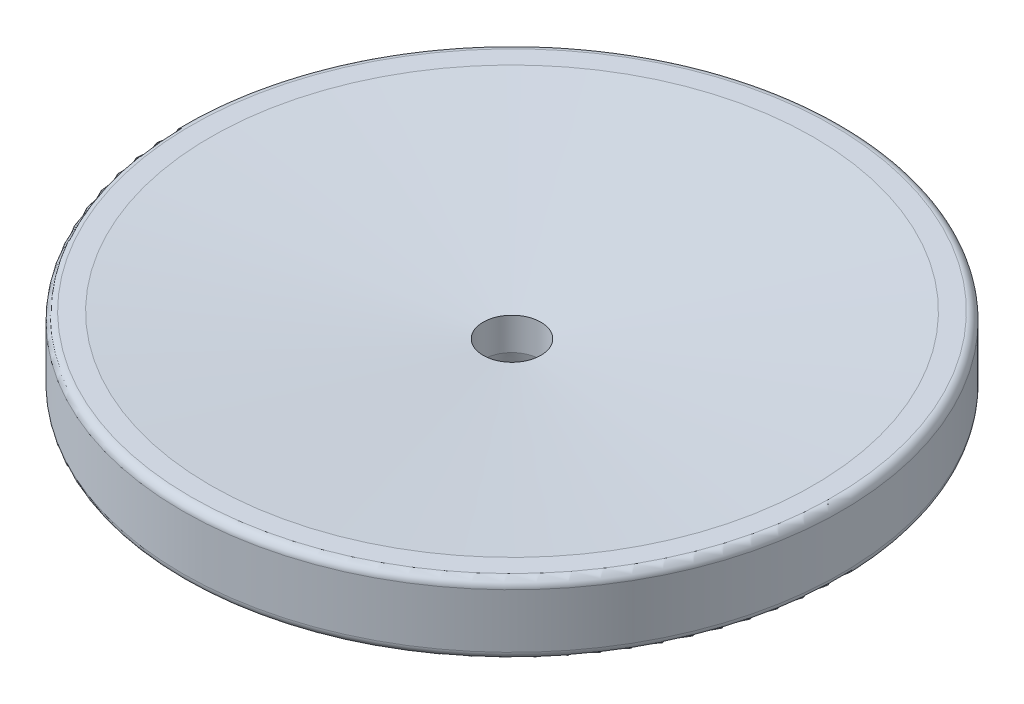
ISO-10303-21;
HEADER;
FILE_DESCRIPTION(('STEP AP214'),'2;1');
FILE_NAME('part.step','',(''),(''),'','','');
FILE_SCHEMA(('AUTOMOTIVE_DESIGN { 1 0 10303 214 1 1 1 1 }'));
ENDSEC;
DATA;
#1=APPLICATION_CONTEXT('core data for automotive mechanical design processes');
#2=APPLICATION_PROTOCOL_DEFINITION('international standard','automotive_design',2000,#1);
#3=PRODUCT_CONTEXT('',#1,'mechanical');
#4=PRODUCT('Part','Part','',(#3));
#5=PRODUCT_RELATED_PRODUCT_CATEGORY('part','',(#4));
#6=PRODUCT_DEFINITION_FORMATION('','',#4);
#7=PRODUCT_DEFINITION_CONTEXT('part definition',#1,'design');
#8=PRODUCT_DEFINITION('design','',#6,#7);
#9=PRODUCT_DEFINITION_SHAPE('','',#8);
#10=(LENGTH_UNIT() NAMED_UNIT(*) SI_UNIT(.MILLI.,.METRE.));
#11=(NAMED_UNIT(*) PLANE_ANGLE_UNIT() SI_UNIT($,.RADIAN.));
#12=(NAMED_UNIT(*) SI_UNIT($,.STERADIAN.) SOLID_ANGLE_UNIT());
#13=UNCERTAINTY_MEASURE_WITH_UNIT(LENGTH_MEASURE(1.E-05),#10,'distance_accuracy_value','');
#14=(GEOMETRIC_REPRESENTATION_CONTEXT(3) GLOBAL_UNCERTAINTY_ASSIGNED_CONTEXT((#13)) GLOBAL_UNIT_ASSIGNED_CONTEXT((#10,
#11,#12)) REPRESENTATION_CONTEXT('',''));
#15=CARTESIAN_POINT('',(0.,0.,0.));
#16=DIRECTION('',(0.,0.,1.));
#17=DIRECTION('',(1.,0.,0.));
#18=AXIS2_PLACEMENT_3D('',#15,#16,#17);
#19=CARTESIAN_POINT('',(0.,0.,0.));
#20=DIRECTION('',(0.,1.,0.));
#21=DIRECTION('',(0.,0.,1.));
#22=AXIS2_PLACEMENT_3D('',#19,#20,#21);
#23=PLANE('',#22);
#24=CARTESIAN_POINT('',(0.,0.,0.));
#25=DIRECTION('',(0.,-1.,0.));
#26=DIRECTION('',(0.,0.,-1.));
#27=AXIS2_PLACEMENT_3D('',#24,#25,#26);
#28=CIRCLE('',#27,41.275);
#29=CARTESIAN_POINT('',(0.,0.,-41.275));
#30=VERTEX_POINT('',#29);
#31=EDGE_CURVE('E64',#30,#30,#28,.T.);
#32=ORIENTED_EDGE('',*,*,#31,.F.);
#33=EDGE_LOOP('',(#32));
#34=FACE_BOUND('',#33,.T.);
#35=CARTESIAN_POINT('',(-41.3984391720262,0.,23.9014000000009));
#36=DIRECTION('',(0.,-1.,0.));
#37=DIRECTION('',(0.,0.,-1.));
#38=AXIS2_PLACEMENT_3D('',#35,#36,#37);
#39=CIRCLE('',#38,1.72719999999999);
#40=CARTESIAN_POINT('',(-41.3984391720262,0.,22.1742000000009));
#41=VERTEX_POINT('',#40);
#42=EDGE_CURVE('E102',#41,#41,#39,.T.);
#43=ORIENTED_EDGE('',*,*,#42,.F.);
#44=EDGE_LOOP('',(#43));
#45=FACE_BOUND('',#44,.T.);
#46=CARTESIAN_POINT('',(-47.8028,0.,1.00267016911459E-12));
#47=DIRECTION('',(0.,-1.,0.));
#48=DIRECTION('',(0.,0.,-1.));
#49=AXIS2_PLACEMENT_3D('',#46,#47,#48);
#50=CIRCLE('',#49,1.72719999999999);
#51=CARTESIAN_POINT('',(-47.8028,0.,-1.72719999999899));
#52=VERTEX_POINT('',#51);
#53=EDGE_CURVE('E108',#52,#52,#50,.T.);
#54=ORIENTED_EDGE('',*,*,#53,.F.);
#55=EDGE_LOOP('',(#54));
#56=FACE_BOUND('',#55,.T.);
#57=CARTESIAN_POINT('',(-41.3984391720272,0.,-23.9013999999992));
#58=DIRECTION('',(0.,-1.,0.));
#59=DIRECTION('',(0.,0.,-1.));
#60=AXIS2_PLACEMENT_3D('',#57,#58,#59);
#61=CIRCLE('',#60,1.72719999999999);
#62=CARTESIAN_POINT('',(-41.3984391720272,0.,-25.6285999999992));
#63=VERTEX_POINT('',#62);
#64=EDGE_CURVE('E116',#63,#63,#61,.T.);
#65=ORIENTED_EDGE('',*,*,#64,.F.);
#66=EDGE_LOOP('',(#65));
#67=FACE_BOUND('',#66,.T.);
#68=CARTESIAN_POINT('',(-23.9014000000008,0.,-41.3984391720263));
#69=DIRECTION('',(0.,-1.,0.));
#70=DIRECTION('',(0.,0.,-1.));
#71=AXIS2_PLACEMENT_3D('',#68,#69,#70);
#72=CIRCLE('',#71,1.72719999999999);
#73=CARTESIAN_POINT('',(-23.9014000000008,0.,-43.1256391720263));
#74=VERTEX_POINT('',#73);
#75=EDGE_CURVE('E123',#74,#74,#72,.T.);
#76=ORIENTED_EDGE('',*,*,#75,.F.);
#77=EDGE_LOOP('',(#76));
#78=FACE_BOUND('',#77,.T.);
#79=CARTESIAN_POINT('',(23.9013999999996,0.,-41.398439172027));
#80=DIRECTION('',(0.,-1.,0.));
#81=DIRECTION('',(0.,0.,-1.));
#82=AXIS2_PLACEMENT_3D('',#79,#80,#81);
#83=CIRCLE('',#82,1.72719999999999);
#84=CARTESIAN_POINT('',(23.9013999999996,0.,-43.125639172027));
#85=VERTEX_POINT('',#84);
#86=EDGE_CURVE('E135',#85,#85,#83,.T.);
#87=ORIENTED_EDGE('',*,*,#86,.F.);
#88=EDGE_LOOP('',(#87));
#89=FACE_BOUND('',#88,.T.);
#90=CARTESIAN_POINT('',(41.3984391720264,0.,-23.9014000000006));
#91=DIRECTION('',(0.,-1.,0.));
#92=DIRECTION('',(0.,0.,-1.));
#93=AXIS2_PLACEMENT_3D('',#90,#91,#92);
#94=CIRCLE('',#93,1.72719999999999);
#95=CARTESIAN_POINT('',(41.3984391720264,0.,-25.6286000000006));
#96=VERTEX_POINT('',#95);
#97=EDGE_CURVE('E141',#96,#96,#94,.T.);
#98=ORIENTED_EDGE('',*,*,#97,.F.);
#99=EDGE_LOOP('',(#98));
#100=FACE_BOUND('',#99,.T.);
#101=CARTESIAN_POINT('',(47.8028,0.,-6.66133814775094E-13));
#102=DIRECTION('',(0.,-1.,0.));
#103=DIRECTION('',(0.,0.,-1.));
#104=AXIS2_PLACEMENT_3D('',#101,#102,#103);
#105=CIRCLE('',#104,1.72719999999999);
#106=CARTESIAN_POINT('',(47.8028,0.,-1.72720000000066));
#107=VERTEX_POINT('',#106);
#108=EDGE_CURVE('E147',#107,#107,#105,.T.);
#109=ORIENTED_EDGE('',*,*,#108,.F.);
#110=EDGE_LOOP('',(#109));
#111=FACE_BOUND('',#110,.T.);
#112=CARTESIAN_POINT('',(41.3984391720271,0.,23.9013999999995));
#113=DIRECTION('',(0.,-1.,0.));
#114=DIRECTION('',(0.,0.,-1.));
#115=AXIS2_PLACEMENT_3D('',#112,#113,#114);
#116=CIRCLE('',#115,1.72719999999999);
#117=CARTESIAN_POINT('',(41.3984391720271,0.,22.1741999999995));
#118=VERTEX_POINT('',#117);
#119=EDGE_CURVE('E153',#118,#118,#116,.T.);
#120=ORIENTED_EDGE('',*,*,#119,.F.);
#121=EDGE_LOOP('',(#120));
#122=FACE_BOUND('',#121,.T.);
#123=CARTESIAN_POINT('',(23.9014000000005,0.,41.3984391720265));
#124=DIRECTION('',(0.,-1.,0.));
#125=DIRECTION('',(0.,0.,-1.));
#126=AXIS2_PLACEMENT_3D('',#123,#124,#125);
#127=CIRCLE('',#126,1.72719999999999);
#128=CARTESIAN_POINT('',(23.9014000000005,0.,39.6712391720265));
#129=VERTEX_POINT('',#128);
#130=EDGE_CURVE('E159',#129,#129,#127,.T.);
#131=ORIENTED_EDGE('',*,*,#130,.F.);
#132=EDGE_LOOP('',(#131));
#133=FACE_BOUND('',#132,.T.);
#134=CARTESIAN_POINT('',(4.9960036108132E-13,0.,47.8028));
#135=DIRECTION('',(0.,-1.,0.));
#136=DIRECTION('',(0.,0.,-1.));
#137=AXIS2_PLACEMENT_3D('',#134,#135,#136);
#138=CIRCLE('',#137,1.72719999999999);
#139=CARTESIAN_POINT('',(4.9960036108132E-13,0.,46.0756));
#140=VERTEX_POINT('',#139);
#141=EDGE_CURVE('E165',#140,#140,#138,.T.);
#142=ORIENTED_EDGE('',*,*,#141,.F.);
#143=EDGE_LOOP('',(#142));
#144=FACE_BOUND('',#143,.T.);
#145=CARTESIAN_POINT('',(-23.9013999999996,0.,41.398439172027));
#146=DIRECTION('',(0.,-1.,0.));
#147=DIRECTION('',(0.,0.,-1.));
#148=AXIS2_PLACEMENT_3D('',#145,#146,#147);
#149=CIRCLE('',#148,1.72719999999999);
#150=CARTESIAN_POINT('',(-23.9013999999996,0.,39.671239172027));
#151=VERTEX_POINT('',#150);
#152=EDGE_CURVE('E171',#151,#151,#149,.T.);
#153=ORIENTED_EDGE('',*,*,#152,.F.);
#154=EDGE_LOOP('',(#153));
#155=FACE_BOUND('',#154,.T.);
#156=CARTESIAN_POINT('',(0.,0.,0.));
#157=DIRECTION('',(0.,1.,0.));
#158=DIRECTION('',(0.,0.,1.));
#159=AXIS2_PLACEMENT_3D('',#156,#157,#158);
#160=CIRCLE('',#159,52.5526);
#161=CARTESIAN_POINT('',(0.,0.,52.5526));
#162=VERTEX_POINT('',#161);
#163=EDGE_CURVE('E201',#162,#162,#160,.T.);
#164=ORIENTED_EDGE('',*,*,#163,.F.);
#165=EDGE_LOOP('',(#164));
#166=FACE_BOUND('',#165,.T.);
#167=CARTESIAN_POINT('',(-8.36136715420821E-13,0.,-47.8028));
#168=DIRECTION('',(0.,-1.,0.));
#169=DIRECTION('',(0.,0.,-1.));
#170=AXIS2_PLACEMENT_3D('',#167,#168,#169);
#171=CIRCLE('',#170,1.72719999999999);
#172=CARTESIAN_POINT('',(-8.36136715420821E-13,0.,-49.53));
#173=VERTEX_POINT('',#172);
#174=EDGE_CURVE('E129',#173,#173,#171,.T.);
#175=ORIENTED_EDGE('',*,*,#174,.F.);
#176=EDGE_LOOP('',(#175));
#177=FACE_BOUND('',#176,.T.);
#178=ADVANCED_FACE('F41',(#34,#45,#56,#67,#78,#89,#100,#111,#122,#133,#144,#155,#166,#177),#23,.F.);
#179=CARTESIAN_POINT('',(0.,13.6144,0.));
#180=DIRECTION('',(0.,-1.,0.));
#181=DIRECTION('',(0.,0.,-1.));
#182=AXIS2_PLACEMENT_3D('',#179,#180,#181);
#183=CYLINDRICAL_SURFACE('',#182,63.5);
#184=CARTESIAN_POINT('',(0.,12.0269,0.));
#185=DIRECTION('',(0.,1.,0.));
#186=DIRECTION('',(0.,0.,1.));
#187=AXIS2_PLACEMENT_3D('',#184,#185,#186);
#188=CIRCLE('',#187,63.5);
#189=CARTESIAN_POINT('',(0.,12.0269,63.5));
#190=VERTEX_POINT('',#189);
#191=EDGE_CURVE('E50',#190,#190,#188,.F.);
#192=ORIENTED_EDGE('',*,*,#191,.T.);
#193=EDGE_LOOP('',(#192));
#194=FACE_BOUND('',#193,.T.);
#195=CARTESIAN_POINT('',(0.,1.5875,0.));
#196=DIRECTION('',(0.,1.,0.));
#197=DIRECTION('',(0.,0.,1.));
#198=AXIS2_PLACEMENT_3D('',#195,#196,#197);
#199=CIRCLE('',#198,63.5);
#200=CARTESIAN_POINT('',(0.,1.5875,63.5));
#201=VERTEX_POINT('',#200);
#202=EDGE_CURVE('E58',#201,#201,#199,.T.);
#203=ORIENTED_EDGE('',*,*,#202,.T.);
#204=EDGE_LOOP('',(#203));
#205=FACE_BOUND('',#204,.T.);
#206=ADVANCED_FACE('F214',(#194,#205),#183,.T.);
#207=CARTESIAN_POINT('',(0.,13.6144,0.));
#208=DIRECTION('',(0.,1.,0.));
#209=DIRECTION('',(0.,0.,1.));
#210=AXIS2_PLACEMENT_3D('',#207,#208,#209);
#211=PLANE('',#210);
#212=CARTESIAN_POINT('',(0.,13.6144,0.));
#213=DIRECTION('',(0.,-1.,0.));
#214=DIRECTION('',(0.,0.,-1.));
#215=AXIS2_PLACEMENT_3D('',#212,#213,#214);
#216=CIRCLE('',#215,58.1025);
#217=CARTESIAN_POINT('',(0.,13.6144,58.1025));
#218=VERTEX_POINT('',#217);
#219=EDGE_CURVE('E84',#218,#218,#216,.T.);
#220=ORIENTED_EDGE('',*,*,#219,.T.);
#221=EDGE_LOOP('',(#220));
#222=FACE_BOUND('',#221,.T.);
#223=CARTESIAN_POINT('',(0.,13.6144,0.));
#224=DIRECTION('',(0.,1.,0.));
#225=DIRECTION('',(0.,0.,1.));
#226=AXIS2_PLACEMENT_3D('',#223,#224,#225);
#227=CIRCLE('',#226,61.9125);
#228=CARTESIAN_POINT('',(0.,13.6144,61.9125));
#229=VERTEX_POINT('',#228);
#230=EDGE_CURVE('E208',#229,#229,#227,.T.);
#231=ORIENTED_EDGE('',*,*,#230,.T.);
#232=EDGE_LOOP('',(#231));
#233=FACE_BOUND('',#232,.T.);
#234=ADVANCED_FACE('F236',(#222,#233),#211,.T.);
#235=CARTESIAN_POINT('',(0.,0.,0.));
#236=DIRECTION('',(0.,1.,0.));
#237=DIRECTION('',(0.,0.,1.));
#238=AXIS2_PLACEMENT_3D('',#235,#236,#237);
#239=CIRCLE('',#238,61.9125);
#240=CARTESIAN_POINT('',(0.,0.,61.9125));
#241=VERTEX_POINT('',#240);
#242=EDGE_CURVE('E10',#241,#241,#239,.F.);
#243=ORIENTED_EDGE('',*,*,#242,.T.);
#244=EDGE_LOOP('',(#243));
#245=FACE_BOUND('',#244,.T.);
#246=CARTESIAN_POINT('',(0.,0.,0.));
#247=DIRECTION('',(0.,1.,0.));
#248=DIRECTION('',(0.,0.,1.));
#249=AXIS2_PLACEMENT_3D('',#246,#247,#248);
#250=CIRCLE('',#249,57.4294);
#251=CARTESIAN_POINT('',(0.,0.,57.4294));
#252=VERTEX_POINT('',#251);
#253=EDGE_CURVE('E205',#252,#252,#250,.T.);
#254=ORIENTED_EDGE('',*,*,#253,.T.);
#255=EDGE_LOOP('',(#254));
#256=FACE_BOUND('',#255,.T.);
#257=ADVANCED_FACE('F232',(#245,#256),#23,.F.);
#258=CARTESIAN_POINT('',(0.,0.126999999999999,0.));
#259=DIRECTION('',(0.,1.,0.));
#260=DIRECTION('',(0.,0.,1.));
#261=AXIS2_PLACEMENT_3D('',#258,#259,#260);
#262=TOROIDAL_SURFACE('',#261,57.4294,0.127000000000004);
#263=ORIENTED_EDGE('',*,*,#253,.F.);
#264=EDGE_LOOP('',(#263));
#265=FACE_BOUND('',#264,.T.);
#266=CARTESIAN_POINT('',(0.,0.126999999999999,0.));
#267=DIRECTION('',(0.,1.,0.));
#268=DIRECTION('',(0.,0.,1.));
#269=AXIS2_PLACEMENT_3D('',#266,#267,#268);
#270=CIRCLE('',#269,57.3024);
#271=CARTESIAN_POINT('',(0.,0.126999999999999,57.3024));
#272=VERTEX_POINT('',#271);
#273=EDGE_CURVE('E177',#272,#272,#270,.T.);
#274=ORIENTED_EDGE('',*,*,#273,.T.);
#275=EDGE_LOOP('',(#274));
#276=FACE_BOUND('',#275,.T.);
#277=ADVANCED_FACE('F242',(#265,#276),#262,.T.);
#278=CARTESIAN_POINT('',(0.,0.127,0.));
#279=DIRECTION('',(0.,1.,0.));
#280=DIRECTION('',(0.,0.,1.));
#281=AXIS2_PLACEMENT_3D('',#278,#279,#280);
#282=TOROIDAL_SURFACE('',#281,52.5526,0.127000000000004);
#283=CARTESIAN_POINT('',(0.,0.127,0.));
#284=DIRECTION('',(0.,1.,0.));
#285=DIRECTION('',(0.,0.,1.));
#286=AXIS2_PLACEMENT_3D('',#283,#284,#285);
#287=CIRCLE('',#286,52.6796);
#288=CARTESIAN_POINT('',(0.,0.127,52.6796));
#289=VERTEX_POINT('',#288);
#290=EDGE_CURVE('E197',#289,#289,#287,.T.);
#291=ORIENTED_EDGE('',*,*,#290,.F.);
#292=EDGE_LOOP('',(#291));
#293=FACE_BOUND('',#292,.T.);
#294=ORIENTED_EDGE('',*,*,#163,.T.);
#295=EDGE_LOOP('',(#294));
#296=FACE_BOUND('',#295,.T.);
#297=ADVANCED_FACE('F247',(#293,#296),#282,.T.);
#298=CARTESIAN_POINT('',(0.,0.,0.));
#299=DIRECTION('',(0.,1.,0.));
#300=DIRECTION('',(0.,0.,1.));
#301=AXIS2_PLACEMENT_3D('',#298,#299,#300);
#302=CYLINDRICAL_SURFACE('',#301,52.6796);
#303=CARTESIAN_POINT('',(0.,2.1971,0.));
#304=DIRECTION('',(0.,1.,0.));
#305=DIRECTION('',(0.,0.,1.));
#306=AXIS2_PLACEMENT_3D('',#303,#304,#305);
#307=CIRCLE('',#306,52.6796);
#308=CARTESIAN_POINT('',(0.,2.1971,52.6796));
#309=VERTEX_POINT('',#308);
#310=EDGE_CURVE('E193',#309,#309,#307,.T.);
#311=ORIENTED_EDGE('',*,*,#310,.F.);
#312=EDGE_LOOP('',(#311));
#313=FACE_BOUND('',#312,.T.);
#314=ORIENTED_EDGE('',*,*,#290,.T.);
#315=EDGE_LOOP('',(#314));
#316=FACE_BOUND('',#315,.T.);
#317=ADVANCED_FACE('F278',(#313,#316),#302,.T.);
#318=CARTESIAN_POINT('',(0.,2.1971,0.));
#319=DIRECTION('',(0.,1.,0.));
#320=DIRECTION('',(0.,0.,1.));
#321=AXIS2_PLACEMENT_3D('',#318,#319,#320);
#322=TOROIDAL_SURFACE('',#321,53.1241,0.4445);
#323=CARTESIAN_POINT('',(0.,2.6416,0.));
#324=DIRECTION('',(0.,1.,0.));
#325=DIRECTION('',(0.,0.,1.));
#326=AXIS2_PLACEMENT_3D('',#323,#324,#325);
#327=CIRCLE('',#326,53.1241);
#328=CARTESIAN_POINT('',(0.,2.6416,53.1241));
#329=VERTEX_POINT('',#328);
#330=EDGE_CURVE('E189',#329,#329,#327,.T.);
#331=ORIENTED_EDGE('',*,*,#330,.F.);
#332=EDGE_LOOP('',(#331));
#333=FACE_BOUND('',#332,.T.);
#334=ORIENTED_EDGE('',*,*,#310,.T.);
#335=EDGE_LOOP('',(#334));
#336=FACE_BOUND('',#335,.T.);
#337=ADVANCED_FACE('F272',(#333,#336),#322,.F.);
#338=CARTESIAN_POINT('',(-56.8579,2.6416,0.));
#339=DIRECTION('',(0.,1.,0.));
#340=DIRECTION('',(0.,0.,1.));
#341=AXIS2_PLACEMENT_3D('',#338,#339,#340);
#342=PLANE('',#341);
#343=CARTESIAN_POINT('',(0.,2.6416,0.));
#344=DIRECTION('',(0.,1.,0.));
#345=DIRECTION('',(0.,0.,1.));
#346=AXIS2_PLACEMENT_3D('',#343,#344,#345);
#347=CIRCLE('',#346,56.8579);
#348=CARTESIAN_POINT('',(0.,2.6416,56.8579));
#349=VERTEX_POINT('',#348);
#350=EDGE_CURVE('E185',#349,#349,#347,.T.);
#351=ORIENTED_EDGE('',*,*,#350,.F.);
#352=EDGE_LOOP('',(#351));
#353=FACE_BOUND('',#352,.T.);
#354=ORIENTED_EDGE('',*,*,#330,.T.);
#355=EDGE_LOOP('',(#354));
#356=FACE_BOUND('',#355,.T.);
#357=ADVANCED_FACE('F266',(#353,#356),#342,.F.);
#358=CARTESIAN_POINT('',(0.,2.1971,0.));
#359=DIRECTION('',(0.,1.,0.));
#360=DIRECTION('',(0.,0.,1.));
#361=AXIS2_PLACEMENT_3D('',#358,#359,#360);
#362=TOROIDAL_SURFACE('',#361,56.8579,0.4445);
#363=CARTESIAN_POINT('',(0.,2.1971,0.));
#364=DIRECTION('',(0.,1.,0.));
#365=DIRECTION('',(0.,0.,1.));
#366=AXIS2_PLACEMENT_3D('',#363,#364,#365);
#367=CIRCLE('',#366,57.3024);
#368=CARTESIAN_POINT('',(0.,2.1971,57.3024));
#369=VERTEX_POINT('',#368);
#370=EDGE_CURVE('E181',#369,#369,#367,.T.);
#371=ORIENTED_EDGE('',*,*,#370,.F.);
#372=EDGE_LOOP('',(#371));
#373=FACE_BOUND('',#372,.T.);
#374=ORIENTED_EDGE('',*,*,#350,.T.);
#375=EDGE_LOOP('',(#374));
#376=FACE_BOUND('',#375,.T.);
#377=ADVANCED_FACE('F260',(#373,#376),#362,.F.);
#378=CARTESIAN_POINT('',(0.,0.,0.));
#379=DIRECTION('',(0.,1.,0.));
#380=DIRECTION('',(0.,0.,1.));
#381=AXIS2_PLACEMENT_3D('',#378,#379,#380);
#382=CYLINDRICAL_SURFACE('',#381,57.3024);
#383=ORIENTED_EDGE('',*,*,#273,.F.);
#384=EDGE_LOOP('',(#383));
#385=FACE_BOUND('',#384,.T.);
#386=ORIENTED_EDGE('',*,*,#370,.T.);
#387=EDGE_LOOP('',(#386));
#388=FACE_BOUND('',#387,.T.);
#389=ADVANCED_FACE('F256',(#385,#388),#382,.F.);
#390=CARTESIAN_POINT('',(-23.9013999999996,8.89,41.398439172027));
#391=DIRECTION('',(0.,1.,0.));
#392=DIRECTION('',(0.,0.,1.));
#393=AXIS2_PLACEMENT_3D('',#390,#391,#392);
#394=PLANE('',#393);
#395=CARTESIAN_POINT('',(-23.9013999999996,8.89,41.398439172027));
#396=DIRECTION('',(0.,-1.,0.));
#397=DIRECTION('',(0.,0.,-1.));
#398=AXIS2_PLACEMENT_3D('',#395,#396,#397);
#399=CIRCLE('',#398,1.7272);
#400=CARTESIAN_POINT('',(-23.9013999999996,8.89,39.671239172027));
#401=VERTEX_POINT('',#400);
#402=EDGE_CURVE('E174',#401,#401,#399,.T.);
#403=ORIENTED_EDGE('',*,*,#402,.T.);
#404=EDGE_LOOP('',(#403));
#405=FACE_BOUND('',#404,.T.);
#406=ADVANCED_FACE('F259',(#405),#394,.F.);
#407=CARTESIAN_POINT('',(-23.9013999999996,0.,41.398439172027));
#408=DIRECTION('',(0.,-1.,0.));
#409=DIRECTION('',(0.,0.,-1.));
#410=AXIS2_PLACEMENT_3D('',#407,#408,#409);
#411=CYLINDRICAL_SURFACE('',#410,1.72719999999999);
#412=ORIENTED_EDGE('',*,*,#402,.F.);
#413=EDGE_LOOP('',(#412));
#414=FACE_BOUND('',#413,.T.);
#415=ORIENTED_EDGE('',*,*,#152,.T.);
#416=EDGE_LOOP('',(#415));
#417=FACE_BOUND('',#416,.T.);
#418=ADVANCED_FACE('F360',(#414,#417),#411,.F.);
#419=CARTESIAN_POINT('',(4.97422939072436E-13,8.89,47.8028));
#420=DIRECTION('',(0.,1.,0.));
#421=DIRECTION('',(0.,0.,1.));
#422=AXIS2_PLACEMENT_3D('',#419,#420,#421);
#423=PLANE('',#422);
#424=CARTESIAN_POINT('',(4.9960036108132E-13,8.89,47.8028));
#425=DIRECTION('',(0.,-1.,0.));
#426=DIRECTION('',(0.,0.,-1.));
#427=AXIS2_PLACEMENT_3D('',#424,#425,#426);
#428=CIRCLE('',#427,1.7272);
#429=CARTESIAN_POINT('',(4.9960036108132E-13,8.89,46.0756));
#430=VERTEX_POINT('',#429);
#431=EDGE_CURVE('E168',#430,#430,#428,.T.);
#432=ORIENTED_EDGE('',*,*,#431,.T.);
#433=EDGE_LOOP('',(#432));
#434=FACE_BOUND('',#433,.T.);
#435=ADVANCED_FACE('F356',(#434),#423,.F.);
#436=CARTESIAN_POINT('',(4.9960036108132E-13,0.,47.8028));
#437=DIRECTION('',(0.,-1.,0.));
#438=DIRECTION('',(0.,0.,-1.));
#439=AXIS2_PLACEMENT_3D('',#436,#437,#438);
#440=CYLINDRICAL_SURFACE('',#439,1.72719999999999);
#441=ORIENTED_EDGE('',*,*,#431,.F.);
#442=EDGE_LOOP('',(#441));
#443=FACE_BOUND('',#442,.T.);
#444=ORIENTED_EDGE('',*,*,#141,.T.);
#445=EDGE_LOOP('',(#444));
#446=FACE_BOUND('',#445,.T.);
#447=ADVANCED_FACE('F352',(#443,#446),#440,.F.);
#448=CARTESIAN_POINT('',(23.9014000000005,8.89,41.3984391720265));
#449=DIRECTION('',(0.,1.,0.));
#450=DIRECTION('',(0.,0.,1.));
#451=AXIS2_PLACEMENT_3D('',#448,#449,#450);
#452=PLANE('',#451);
#453=CARTESIAN_POINT('',(23.9014000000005,8.89,41.3984391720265));
#454=DIRECTION('',(0.,-1.,0.));
#455=DIRECTION('',(0.,0.,-1.));
#456=AXIS2_PLACEMENT_3D('',#453,#454,#455);
#457=CIRCLE('',#456,1.7272);
#458=CARTESIAN_POINT('',(23.9014000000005,8.89,39.6712391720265));
#459=VERTEX_POINT('',#458);
#460=EDGE_CURVE('E162',#459,#459,#457,.T.);
#461=ORIENTED_EDGE('',*,*,#460,.T.);
#462=EDGE_LOOP('',(#461));
#463=FACE_BOUND('',#462,.T.);
#464=ADVANCED_FACE('F348',(#463),#452,.F.);
#465=CARTESIAN_POINT('',(23.9014000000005,0.,41.3984391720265));
#466=DIRECTION('',(0.,-1.,0.));
#467=DIRECTION('',(0.,0.,-1.));
#468=AXIS2_PLACEMENT_3D('',#465,#466,#467);
#469=CYLINDRICAL_SURFACE('',#468,1.72719999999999);
#470=ORIENTED_EDGE('',*,*,#460,.F.);
#471=EDGE_LOOP('',(#470));
#472=FACE_BOUND('',#471,.T.);
#473=ORIENTED_EDGE('',*,*,#130,.T.);
#474=EDGE_LOOP('',(#473));
#475=FACE_BOUND('',#474,.T.);
#476=ADVANCED_FACE('F344',(#472,#475),#469,.F.);
#477=CARTESIAN_POINT('',(41.3984391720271,8.89,23.9013999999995));
#478=DIRECTION('',(0.,1.,0.));
#479=DIRECTION('',(0.,0.,1.));
#480=AXIS2_PLACEMENT_3D('',#477,#478,#479);
#481=PLANE('',#480);
#482=CARTESIAN_POINT('',(41.3984391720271,8.89,23.9013999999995));
#483=DIRECTION('',(0.,-1.,0.));
#484=DIRECTION('',(0.,0.,-1.));
#485=AXIS2_PLACEMENT_3D('',#482,#483,#484);
#486=CIRCLE('',#485,1.7272);
#487=CARTESIAN_POINT('',(41.3984391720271,8.89,22.1741999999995));
#488=VERTEX_POINT('',#487);
#489=EDGE_CURVE('E156',#488,#488,#486,.T.);
#490=ORIENTED_EDGE('',*,*,#489,.T.);
#491=EDGE_LOOP('',(#490));
#492=FACE_BOUND('',#491,.T.);
#493=ADVANCED_FACE('F340',(#492),#481,.F.);
#494=CARTESIAN_POINT('',(41.3984391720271,0.,23.9013999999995));
#495=DIRECTION('',(0.,-1.,0.));
#496=DIRECTION('',(0.,0.,-1.));
#497=AXIS2_PLACEMENT_3D('',#494,#495,#496);
#498=CYLINDRICAL_SURFACE('',#497,1.72719999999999);
#499=ORIENTED_EDGE('',*,*,#489,.F.);
#500=EDGE_LOOP('',(#499));
#501=FACE_BOUND('',#500,.T.);
#502=ORIENTED_EDGE('',*,*,#119,.T.);
#503=EDGE_LOOP('',(#502));
#504=FACE_BOUND('',#503,.T.);
#505=ADVANCED_FACE('F336',(#501,#504),#498,.F.);
#506=CARTESIAN_POINT('',(47.8028,8.88999999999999,-6.66133814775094E-13));
#507=DIRECTION('',(0.,1.,0.));
#508=DIRECTION('',(0.,0.,1.));
#509=AXIS2_PLACEMENT_3D('',#506,#507,#508);
#510=PLANE('',#509);
#511=CARTESIAN_POINT('',(47.8028,8.88999999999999,-6.66133814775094E-13));
#512=DIRECTION('',(0.,-1.,0.));
#513=DIRECTION('',(0.,0.,-1.));
#514=AXIS2_PLACEMENT_3D('',#511,#512,#513);
#515=CIRCLE('',#514,1.7272);
#516=CARTESIAN_POINT('',(47.8028,8.88999999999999,-1.72720000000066));
#517=VERTEX_POINT('',#516);
#518=EDGE_CURVE('E150',#517,#517,#515,.T.);
#519=ORIENTED_EDGE('',*,*,#518,.T.);
#520=EDGE_LOOP('',(#519));
#521=FACE_BOUND('',#520,.T.);
#522=ADVANCED_FACE('F332',(#521),#510,.F.);
#523=CARTESIAN_POINT('',(47.8028,0.,-6.66133814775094E-13));
#524=DIRECTION('',(0.,-1.,0.));
#525=DIRECTION('',(0.,0.,-1.));
#526=AXIS2_PLACEMENT_3D('',#523,#524,#525);
#527=CYLINDRICAL_SURFACE('',#526,1.72719999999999);
#528=ORIENTED_EDGE('',*,*,#518,.F.);
#529=EDGE_LOOP('',(#528));
#530=FACE_BOUND('',#529,.T.);
#531=ORIENTED_EDGE('',*,*,#108,.T.);
#532=EDGE_LOOP('',(#531));
#533=FACE_BOUND('',#532,.T.);
#534=ADVANCED_FACE('F328',(#530,#533),#527,.F.);
#535=CARTESIAN_POINT('',(41.3984391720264,8.88999999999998,-23.9014000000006));
#536=DIRECTION('',(0.,1.,0.));
#537=DIRECTION('',(0.,0.,1.));
#538=AXIS2_PLACEMENT_3D('',#535,#536,#537);
#539=PLANE('',#538);
#540=CARTESIAN_POINT('',(41.3984391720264,8.88999999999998,-23.9014000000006));
#541=DIRECTION('',(0.,-1.,0.));
#542=DIRECTION('',(0.,0.,-1.));
#543=AXIS2_PLACEMENT_3D('',#540,#541,#542);
#544=CIRCLE('',#543,1.7272);
#545=CARTESIAN_POINT('',(41.3984391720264,8.88999999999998,-25.6286000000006));
#546=VERTEX_POINT('',#545);
#547=EDGE_CURVE('E144',#546,#546,#544,.T.);
#548=ORIENTED_EDGE('',*,*,#547,.T.);
#549=EDGE_LOOP('',(#548));
#550=FACE_BOUND('',#549,.T.);
#551=ADVANCED_FACE('F324',(#550),#539,.F.);
#552=CARTESIAN_POINT('',(41.3984391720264,0.,-23.9014000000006));
#553=DIRECTION('',(0.,-1.,0.));
#554=DIRECTION('',(0.,0.,-1.));
#555=AXIS2_PLACEMENT_3D('',#552,#553,#554);
#556=CYLINDRICAL_SURFACE('',#555,1.72719999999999);
#557=ORIENTED_EDGE('',*,*,#547,.F.);
#558=EDGE_LOOP('',(#557));
#559=FACE_BOUND('',#558,.T.);
#560=ORIENTED_EDGE('',*,*,#97,.T.);
#561=EDGE_LOOP('',(#560));
#562=FACE_BOUND('',#561,.T.);
#563=ADVANCED_FACE('F320',(#559,#562),#556,.F.);
#564=CARTESIAN_POINT('',(23.9013999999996,8.88999999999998,-41.398439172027));
#565=DIRECTION('',(0.,1.,0.));
#566=DIRECTION('',(0.,0.,1.));
#567=AXIS2_PLACEMENT_3D('',#564,#565,#566);
#568=PLANE('',#567);
#569=CARTESIAN_POINT('',(23.9013999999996,8.88999999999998,-41.398439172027));
#570=DIRECTION('',(0.,-1.,0.));
#571=DIRECTION('',(0.,0.,-1.));
#572=AXIS2_PLACEMENT_3D('',#569,#570,#571);
#573=CIRCLE('',#572,1.7272);
#574=CARTESIAN_POINT('',(23.9013999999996,8.88999999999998,-43.125639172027));
#575=VERTEX_POINT('',#574);
#576=EDGE_CURVE('E138',#575,#575,#573,.T.);
#577=ORIENTED_EDGE('',*,*,#576,.T.);
#578=EDGE_LOOP('',(#577));
#579=FACE_BOUND('',#578,.T.);
#580=ADVANCED_FACE('F316',(#579),#568,.F.);
#581=CARTESIAN_POINT('',(23.9013999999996,0.,-41.398439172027));
#582=DIRECTION('',(0.,-1.,0.));
#583=DIRECTION('',(0.,0.,-1.));
#584=AXIS2_PLACEMENT_3D('',#581,#582,#583);
#585=CYLINDRICAL_SURFACE('',#584,1.72719999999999);
#586=ORIENTED_EDGE('',*,*,#576,.F.);
#587=EDGE_LOOP('',(#586));
#588=FACE_BOUND('',#587,.T.);
#589=ORIENTED_EDGE('',*,*,#86,.T.);
#590=EDGE_LOOP('',(#589));
#591=FACE_BOUND('',#590,.T.);
#592=ADVANCED_FACE('F308',(#588,#591),#585,.F.);
#593=CARTESIAN_POINT('',(-8.38314137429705E-13,8.88999999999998,-47.8028));
#594=DIRECTION('',(0.,1.,0.));
#595=DIRECTION('',(0.,0.,1.));
#596=AXIS2_PLACEMENT_3D('',#593,#594,#595);
#597=PLANE('',#596);
#598=CARTESIAN_POINT('',(-8.36136715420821E-13,8.88999999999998,-47.8028));
#599=DIRECTION('',(0.,-1.,0.));
#600=DIRECTION('',(0.,0.,-1.));
#601=AXIS2_PLACEMENT_3D('',#598,#599,#600);
#602=CIRCLE('',#601,1.7272);
#603=CARTESIAN_POINT('',(-8.36136715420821E-13,8.88999999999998,-49.53));
#604=VERTEX_POINT('',#603);
#605=EDGE_CURVE('E132',#604,#604,#602,.T.);
#606=ORIENTED_EDGE('',*,*,#605,.T.);
#607=EDGE_LOOP('',(#606));
#608=FACE_BOUND('',#607,.T.);
#609=ADVANCED_FACE('F298',(#608),#597,.F.);
#610=CARTESIAN_POINT('',(-8.36136715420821E-13,0.,-47.8028));
#611=DIRECTION('',(0.,-1.,0.));
#612=DIRECTION('',(0.,0.,-1.));
#613=AXIS2_PLACEMENT_3D('',#610,#611,#612);
#614=CYLINDRICAL_SURFACE('',#613,1.72719999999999);
#615=ORIENTED_EDGE('',*,*,#605,.F.);
#616=EDGE_LOOP('',(#615));
#617=FACE_BOUND('',#616,.T.);
#618=ORIENTED_EDGE('',*,*,#174,.T.);
#619=EDGE_LOOP('',(#618));
#620=FACE_BOUND('',#619,.T.);
#621=ADVANCED_FACE('F295',(#617,#620),#614,.F.);
#622=CARTESIAN_POINT('',(-23.9014000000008,8.88999999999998,-41.3984391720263));
#623=DIRECTION('',(0.,1.,0.));
#624=DIRECTION('',(0.,0.,1.));
#625=AXIS2_PLACEMENT_3D('',#622,#623,#624);
#626=PLANE('',#625);
#627=CARTESIAN_POINT('',(-23.9014000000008,8.88999999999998,-41.3984391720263));
#628=DIRECTION('',(0.,-1.,0.));
#629=DIRECTION('',(0.,0.,-1.));
#630=AXIS2_PLACEMENT_3D('',#627,#628,#629);
#631=CIRCLE('',#630,1.7272);
#632=CARTESIAN_POINT('',(-23.9014000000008,8.88999999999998,-43.1256391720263));
#633=VERTEX_POINT('',#632);
#634=EDGE_CURVE('E126',#633,#633,#631,.T.);
#635=ORIENTED_EDGE('',*,*,#634,.T.);
#636=EDGE_LOOP('',(#635));
#637=FACE_BOUND('',#636,.T.);
#638=ADVANCED_FACE('F297',(#637),#626,.F.);
#639=CARTESIAN_POINT('',(-23.9014000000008,0.,-41.3984391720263));
#640=DIRECTION('',(0.,-1.,0.));
#641=DIRECTION('',(0.,0.,-1.));
#642=AXIS2_PLACEMENT_3D('',#639,#640,#641);
#643=CYLINDRICAL_SURFACE('',#642,1.72719999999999);
#644=ORIENTED_EDGE('',*,*,#634,.F.);
#645=EDGE_LOOP('',(#644));
#646=FACE_BOUND('',#645,.T.);
#647=ORIENTED_EDGE('',*,*,#75,.T.);
#648=EDGE_LOOP('',(#647));
#649=FACE_BOUND('',#648,.T.);
#650=ADVANCED_FACE('F305',(#646,#649),#643,.F.);
#651=CARTESIAN_POINT('',(-41.3984391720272,8.88999999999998,-23.9013999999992));
#652=DIRECTION('',(0.,1.,0.));
#653=DIRECTION('',(0.,0.,1.));
#654=AXIS2_PLACEMENT_3D('',#651,#652,#653);
#655=PLANE('',#654);
#656=CARTESIAN_POINT('',(-41.3984391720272,8.88999999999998,-23.9013999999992));
#657=DIRECTION('',(0.,-1.,0.));
#658=DIRECTION('',(0.,0.,-1.));
#659=AXIS2_PLACEMENT_3D('',#656,#657,#658);
#660=CIRCLE('',#659,1.7272);
#661=CARTESIAN_POINT('',(-41.3984391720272,8.88999999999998,-25.6285999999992));
#662=VERTEX_POINT('',#661);
#663=EDGE_CURVE('E120',#662,#662,#660,.T.);
#664=ORIENTED_EDGE('',*,*,#663,.T.);
#665=EDGE_LOOP('',(#664));
#666=FACE_BOUND('',#665,.T.);
#667=ADVANCED_FACE('F461',(#666),#655,.F.);
#668=CARTESIAN_POINT('',(-41.3984391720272,0.,-23.9013999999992));
#669=DIRECTION('',(0.,-1.,0.));
#670=DIRECTION('',(0.,0.,-1.));
#671=AXIS2_PLACEMENT_3D('',#668,#669,#670);
#672=CYLINDRICAL_SURFACE('',#671,1.72719999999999);
#673=ORIENTED_EDGE('',*,*,#663,.F.);
#674=EDGE_LOOP('',(#673));
#675=FACE_BOUND('',#674,.T.);
#676=ORIENTED_EDGE('',*,*,#64,.T.);
#677=EDGE_LOOP('',(#676));
#678=FACE_BOUND('',#677,.T.);
#679=ADVANCED_FACE('F470',(#675,#678),#672,.F.);
#680=CARTESIAN_POINT('',(-47.8028,8.88999999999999,1.00267016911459E-12));
#681=DIRECTION('',(0.,1.,0.));
#682=DIRECTION('',(0.,0.,1.));
#683=AXIS2_PLACEMENT_3D('',#680,#681,#682);
#684=PLANE('',#683);
#685=CARTESIAN_POINT('',(-47.8028,8.88999999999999,1.00267016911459E-12));
#686=DIRECTION('',(0.,-1.,0.));
#687=DIRECTION('',(0.,0.,-1.));
#688=AXIS2_PLACEMENT_3D('',#685,#686,#687);
#689=CIRCLE('',#688,1.7272);
#690=CARTESIAN_POINT('',(-47.8028,8.88999999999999,-1.727199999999));
#691=VERTEX_POINT('',#690);
#692=EDGE_CURVE('E112',#691,#691,#689,.T.);
#693=ORIENTED_EDGE('',*,*,#692,.T.);
#694=EDGE_LOOP('',(#693));
#695=FACE_BOUND('',#694,.T.);
#696=ADVANCED_FACE('F480',(#695),#684,.F.);
#697=CARTESIAN_POINT('',(-47.8028,0.,1.00267016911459E-12));
#698=DIRECTION('',(0.,-1.,0.));
#699=DIRECTION('',(0.,0.,-1.));
#700=AXIS2_PLACEMENT_3D('',#697,#698,#699);
#701=CYLINDRICAL_SURFACE('',#700,1.72719999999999);
#702=ORIENTED_EDGE('',*,*,#692,.F.);
#703=EDGE_LOOP('',(#702));
#704=FACE_BOUND('',#703,.T.);
#705=ORIENTED_EDGE('',*,*,#53,.T.);
#706=EDGE_LOOP('',(#705));
#707=FACE_BOUND('',#706,.T.);
#708=ADVANCED_FACE('F490',(#704,#707),#701,.F.);
#709=CARTESIAN_POINT('',(-41.3984391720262,8.89,23.9014000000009));
#710=DIRECTION('',(0.,1.,0.));
#711=DIRECTION('',(0.,0.,1.));
#712=AXIS2_PLACEMENT_3D('',#709,#710,#711);
#713=PLANE('',#712);
#714=CARTESIAN_POINT('',(-41.3984391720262,8.89,23.9014000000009));
#715=DIRECTION('',(0.,-1.,0.));
#716=DIRECTION('',(0.,0.,-1.));
#717=AXIS2_PLACEMENT_3D('',#714,#715,#716);
#718=CIRCLE('',#717,1.7272);
#719=CARTESIAN_POINT('',(-41.3984391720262,8.89,22.1742000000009));
#720=VERTEX_POINT('',#719);
#721=EDGE_CURVE('E105',#720,#720,#718,.T.);
#722=ORIENTED_EDGE('',*,*,#721,.T.);
#723=EDGE_LOOP('',(#722));
#724=FACE_BOUND('',#723,.T.);
#725=ADVANCED_FACE('F500',(#724),#713,.F.);
#726=CARTESIAN_POINT('',(-41.3984391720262,0.,23.9014000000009));
#727=DIRECTION('',(0.,-1.,0.));
#728=DIRECTION('',(0.,0.,-1.));
#729=AXIS2_PLACEMENT_3D('',#726,#727,#728);
#730=CYLINDRICAL_SURFACE('',#729,1.72719999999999);
#731=ORIENTED_EDGE('',*,*,#721,.F.);
#732=EDGE_LOOP('',(#731));
#733=FACE_BOUND('',#732,.T.);
#734=ORIENTED_EDGE('',*,*,#42,.T.);
#735=EDGE_LOOP('',(#734));
#736=FACE_BOUND('',#735,.T.);
#737=ADVANCED_FACE('F227',(#733,#736),#730,.F.);
#738=CARTESIAN_POINT('',(0.,12.0269,0.));
#739=DIRECTION('',(0.,1.,0.));
#740=DIRECTION('',(0.,0.,1.));
#741=AXIS2_PLACEMENT_3D('',#738,#739,#740);
#742=TOROIDAL_SURFACE('',#741,61.9125,1.5875);
#743=ORIENTED_EDGE('',*,*,#191,.F.);
#744=EDGE_LOOP('',(#743));
#745=FACE_BOUND('',#744,.T.);
#746=ORIENTED_EDGE('',*,*,#230,.F.);
#747=EDGE_LOOP('',(#746));
#748=FACE_BOUND('',#747,.T.);
#749=ADVANCED_FACE('F218',(#745,#748),#742,.T.);
#750=CARTESIAN_POINT('',(0.,1.5875,0.));
#751=DIRECTION('',(0.,1.,0.));
#752=DIRECTION('',(0.,0.,1.));
#753=AXIS2_PLACEMENT_3D('',#750,#751,#752);
#754=TOROIDAL_SURFACE('',#753,61.9125,1.5875);
#755=ORIENTED_EDGE('',*,*,#242,.F.);
#756=EDGE_LOOP('',(#755));
#757=FACE_BOUND('',#756,.T.);
#758=ORIENTED_EDGE('',*,*,#202,.F.);
#759=EDGE_LOOP('',(#758));
#760=FACE_BOUND('',#759,.T.);
#761=ADVANCED_FACE('F43',(#757,#760),#754,.T.);
#762=CARTESIAN_POINT('',(0.,13.6144,0.));
#763=DIRECTION('',(0.,1.,0.));
#764=DIRECTION('',(0.,0.,1.));
#765=AXIS2_PLACEMENT_3D('',#762,#763,#764);
#766=CONICAL_SURFACE('',#765,58.1025,1.48352986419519);
#767=CARTESIAN_POINT('',(0.,9.01719881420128,0.));
#768=DIRECTION('',(0.,1.,0.));
#769=DIRECTION('',(0.,0.,1.));
#770=AXIS2_PLACEMENT_3D('',#767,#768,#769);
#771=CIRCLE('',#770,5.55625);
#772=CARTESIAN_POINT('',(0.,9.01719881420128,5.55625));
#773=VERTEX_POINT('',#772);
#774=EDGE_CURVE('E61',#773,#773,#771,.F.);
#775=CARTESIAN_POINT('',(0.,13.6144,58.1025));
#776=CARTESIAN_POINT('',(0.,13.5665124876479,57.5551432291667));
#777=CARTESIAN_POINT('',(0.,13.5186249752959,57.0077864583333));
#778=CARTESIAN_POINT('',(0.,13.4228499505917,55.9130729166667));
#779=CARTESIAN_POINT('',(0.,13.3749624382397,55.3657161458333));
#780=CARTESIAN_POINT('',(0.,13.2791874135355,54.2710026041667));
#781=CARTESIAN_POINT('',(0.,13.2312999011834,53.7236458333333));
#782=CARTESIAN_POINT('',(0.,13.1355248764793,52.6289322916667));
#783=CARTESIAN_POINT('',(0.,13.0876373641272,52.0815755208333));
#784=CARTESIAN_POINT('',(0.,12.9918623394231,50.9868619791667));
#785=CARTESIAN_POINT('',(0.,12.943974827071,50.4395052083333));
#786=CARTESIAN_POINT('',(0.,12.8481998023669,49.3447916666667));
#787=CARTESIAN_POINT('',(0.,12.8003122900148,48.7974348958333));
#788=CARTESIAN_POINT('',(0.,12.7045372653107,47.7027213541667));
#789=CARTESIAN_POINT('',(0.,12.6566497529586,47.1553645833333));
#790=CARTESIAN_POINT('',(0.,12.5608747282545,46.0606510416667));
#791=CARTESIAN_POINT('',(0.,12.5129872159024,45.5132942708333));
#792=CARTESIAN_POINT('',(0.,12.4172121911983,44.4185807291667));
#793=CARTESIAN_POINT('',(0.,12.3693246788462,43.8712239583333));
#794=CARTESIAN_POINT('',(0.,12.273549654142,42.7765104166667));
#795=CARTESIAN_POINT('',(0.,12.22566214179,42.2291536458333));
#796=CARTESIAN_POINT('',(0.,12.1298871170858,41.1344401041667));
#797=CARTESIAN_POINT('',(0.,12.0819996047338,40.5870833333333));
#798=CARTESIAN_POINT('',(0.,11.9862245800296,39.4923697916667));
#799=CARTESIAN_POINT('',(0.,11.9383370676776,38.9450130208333));
#800=CARTESIAN_POINT('',(0.,11.8425620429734,37.8502994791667));
#801=CARTESIAN_POINT('',(0.,11.7946745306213,37.3029427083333));
#802=CARTESIAN_POINT('',(0.,11.6988995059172,36.2082291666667));
#803=CARTESIAN_POINT('',(0.,11.6510119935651,35.6608723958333));
#804=CARTESIAN_POINT('',(0.,11.555236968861,34.5661588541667));
#805=CARTESIAN_POINT('',(0.,11.5073494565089,34.0188020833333));
#806=CARTESIAN_POINT('',(0.,11.4115744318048,32.9240885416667));
#807=CARTESIAN_POINT('',(0.,11.3636869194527,32.3767317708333));
#808=CARTESIAN_POINT('',(0.,11.2679118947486,31.2820182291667));
#809=CARTESIAN_POINT('',(0.,11.2200243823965,30.7346614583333));
#810=CARTESIAN_POINT('',(0.,11.1242493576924,29.6399479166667));
#811=CARTESIAN_POINT('',(0.,11.0763618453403,29.0925911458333));
#812=CARTESIAN_POINT('',(0.,10.9805868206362,27.9978776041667));
#813=CARTESIAN_POINT('',(0.,10.9326993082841,27.4505208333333));
#814=CARTESIAN_POINT('',(0.,10.8369242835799,26.3558072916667));
#815=CARTESIAN_POINT('',(0.,10.7890367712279,25.8084505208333));
#816=CARTESIAN_POINT('',(0.,10.6932617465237,24.7137369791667));
#817=CARTESIAN_POINT('',(0.,10.6453742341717,24.1663802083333));
#818=CARTESIAN_POINT('',(0.,10.5495992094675,23.0716666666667));
#819=CARTESIAN_POINT('',(0.,10.5017116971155,22.5243098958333));
#820=CARTESIAN_POINT('',(0.,10.4059366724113,21.4295963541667));
#821=CARTESIAN_POINT('',(0.,10.3580491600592,20.8822395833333));
#822=CARTESIAN_POINT('',(0.,10.2622741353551,19.7875260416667));
#823=CARTESIAN_POINT('',(0.,10.214386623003,19.2401692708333));
#824=CARTESIAN_POINT('',(0.,10.1186115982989,18.1454557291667));
#825=CARTESIAN_POINT('',(0.,10.0707240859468,17.5980989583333));
#826=CARTESIAN_POINT('',(0.,9.97494906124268,16.5033854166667));
#827=CARTESIAN_POINT('',(0.,9.92706154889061,15.9560286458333));
#828=CARTESIAN_POINT('',(0.,9.83128652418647,14.8613151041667));
#829=CARTESIAN_POINT('',(0.,9.7833990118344,14.3139583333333));
#830=CARTESIAN_POINT('',(0.,9.68762398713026,13.2192447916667));
#831=CARTESIAN_POINT('',(0.,9.63973647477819,12.6718880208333));
#832=CARTESIAN_POINT('',(0.,9.54396145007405,11.5771744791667));
#833=CARTESIAN_POINT('',(0.,9.49607393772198,11.0298177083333));
#834=CARTESIAN_POINT('',(0.,9.40029891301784,9.93510416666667));
#835=CARTESIAN_POINT('',(0.,9.35241140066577,9.38774739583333));
#836=CARTESIAN_POINT('',(0.,9.25663637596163,8.29303385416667));
#837=CARTESIAN_POINT('',(0.,9.20874886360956,7.74567708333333));
#838=CARTESIAN_POINT('',(0.,9.11297383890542,6.65096354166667));
#839=CARTESIAN_POINT('',(0.,9.06508632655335,6.10360677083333));
#840=CARTESIAN_POINT('',(0.,9.01719881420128,5.55625));
#841=B_SPLINE_CURVE_WITH_KNOTS('',3,(#775,#776,#777,#778,#779,#780,#781,#782,#783,#784,#785,
#786,#787,#788,#789,#790,#791,#792,#793,#794,#795,#796,#797,#798,#799,#800,#801,#802,#803,#804,
#805,#806,#807,#808,#809,#810,#811,#812,#813,#814,#815,#816,#817,#818,#819,#820,#821,#822,#823,
#824,#825,#826,#827,#828,#829,#830,#831,#832,#833,#834,#835,#836,#837,#838,#839,#840),
.UNSPECIFIED.,.F.,.F.,(4,2,2,2,2,2,2,2,2,2,2,2,2,2,2,2,2,2,2,2,2,2,2,2,2,2,2,2,2,2,2,2,4),(0.,
1.6483427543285,3.29668550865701,4.94502826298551,6.59337101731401,8.24171377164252,
9.89005652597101,11.5383992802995,13.186742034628,14.8350847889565,16.483427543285,
18.1317702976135,19.780113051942,21.4284558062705,23.076798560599,24.7251413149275,
26.373484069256,28.0218268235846,29.6701695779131,31.3185123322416,32.9668550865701,
34.6151978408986,36.2635405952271,37.9118833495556,39.5602261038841,41.2085688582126,
42.8569116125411,44.5052543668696,46.1535971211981,47.8019398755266,49.4502826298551,
51.0986253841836,52.7469681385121),.UNSPECIFIED.);
#842=EDGE_CURVE('BSEAM217',#218,#773,#841,.T.);
#843=ORIENTED_EDGE('',*,*,#219,.F.);
#844=ORIENTED_EDGE('',*,*,#774,.T.);
#845=ORIENTED_EDGE('',*,*,#842,.T.);
#846=ORIENTED_EDGE('',*,*,#842,.F.);
#847=EDGE_LOOP('',(#843,#845,#844,#846));
#848=FACE_BOUND('',#847,.T.);
#849=ADVANCED_FACE('F217',(#848),#766,.F.);
#850=CARTESIAN_POINT('',(0.,0.,0.));
#851=DIRECTION('',(0.,1.,0.));
#852=DIRECTION('',(0.,0.,1.));
#853=AXIS2_PLACEMENT_3D('',#850,#851,#852);
#854=CONICAL_SURFACE('',#853,8.255,1.41814699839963);
#855=CARTESIAN_POINT('',(0.,4.51726437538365,0.));
#856=DIRECTION('',(0.,-1.,0.));
#857=DIRECTION('',(0.,0.,-1.));
#858=AXIS2_PLACEMENT_3D('',#855,#856,#857);
#859=CIRCLE('',#858,37.6172184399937);
#860=CARTESIAN_POINT('',(0.,4.51726437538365,37.6172184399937));
#861=VERTEX_POINT('',#860);
#862=EDGE_CURVE('E80',#861,#861,#859,.T.);
#863=CARTESIAN_POINT('',(0.,0.253999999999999,0.));
#864=DIRECTION('',(0.,1.,0.));
#865=DIRECTION('',(0.,0.,1.));
#866=AXIS2_PLACEMENT_3D('',#863,#864,#865);
#867=CIRCLE('',#866,9.906);
#868=CARTESIAN_POINT('',(0.,0.253999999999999,9.90599999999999));
#869=VERTEX_POINT('',#868);
#870=EDGE_CURVE('E45',#869,#869,#867,.T.);
#871=CARTESIAN_POINT('',(0.,4.51726437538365,37.6172184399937));
#872=CARTESIAN_POINT('',(0.,4.4728553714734,37.3285599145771));
#873=CARTESIAN_POINT('',(0.,4.42844636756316,37.0399013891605));
#874=CARTESIAN_POINT('',(0.,4.33962835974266,36.4625843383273));
#875=CARTESIAN_POINT('',(0.,4.29521935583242,36.1739258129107));
#876=CARTESIAN_POINT('',(0.,4.20640134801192,35.5966087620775));
#877=CARTESIAN_POINT('',(0.,4.16199234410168,35.3079502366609));
#878=CARTESIAN_POINT('',(0.,4.07317433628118,34.7306331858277));
#879=CARTESIAN_POINT('',(0.,4.02876533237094,34.4419746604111));
#880=CARTESIAN_POINT('',(0.,3.93994732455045,33.8646576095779));
#881=CARTESIAN_POINT('',(0.,3.8955383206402,33.5759990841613));
#882=CARTESIAN_POINT('',(0.,3.80672031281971,32.9986820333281));
#883=CARTESIAN_POINT('',(0.,3.76231130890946,32.7100235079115));
#884=CARTESIAN_POINT('',(0.,3.67349330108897,32.1327064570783));
#885=CARTESIAN_POINT('',(0.,3.62908429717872,31.8440479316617));
#886=CARTESIAN_POINT('',(0.,3.54026628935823,31.2667308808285));
#887=CARTESIAN_POINT('',(0.,3.49585728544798,30.9780723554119));
#888=CARTESIAN_POINT('',(0.,3.40703927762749,30.4007553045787));
#889=CARTESIAN_POINT('',(0.,3.36263027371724,30.1120967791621));
#890=CARTESIAN_POINT('',(0.,3.27381226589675,29.5347797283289));
#891=CARTESIAN_POINT('',(0.,3.2294032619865,29.2461212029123));
#892=CARTESIAN_POINT('',(0.,3.14058525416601,28.6688041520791));
#893=CARTESIAN_POINT('',(0.,3.09617625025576,28.3801456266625));
#894=CARTESIAN_POINT('',(0.,3.00735824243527,27.8028285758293));
#895=CARTESIAN_POINT('',(0.,2.96294923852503,27.5141700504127));
#896=CARTESIAN_POINT('',(0.,2.87413123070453,26.9368529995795));
#897=CARTESIAN_POINT('',(0.,2.82972222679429,26.6481944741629));
#898=CARTESIAN_POINT('',(0.,2.74090421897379,26.0708774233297));
#899=CARTESIAN_POINT('',(0.,2.69649521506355,25.7822188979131));
#900=CARTESIAN_POINT('',(0.,2.60767720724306,25.2049018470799));
#901=CARTESIAN_POINT('',(0.,2.56326820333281,24.9162433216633));
#902=CARTESIAN_POINT('',(0.,2.47445019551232,24.3389262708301));
#903=CARTESIAN_POINT('',(0.,2.43004119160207,24.0502677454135));
#904=CARTESIAN_POINT('',(0.,2.34122318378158,23.4729506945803));
#905=CARTESIAN_POINT('',(0.,2.29681417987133,23.1842921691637));
#906=CARTESIAN_POINT('',(0.,2.20799617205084,22.6069751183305));
#907=CARTESIAN_POINT('',(0.,2.16358716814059,22.3183165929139));
#908=CARTESIAN_POINT('',(0.,2.0747691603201,21.7409995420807));
#909=CARTESIAN_POINT('',(0.,2.03036015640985,21.452341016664));
#910=CARTESIAN_POINT('',(0.,1.94154214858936,20.8750239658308));
#911=CARTESIAN_POINT('',(0.,1.89713314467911,20.5863654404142));
#912=CARTESIAN_POINT('',(0.,1.80831513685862,20.009048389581));
#913=CARTESIAN_POINT('',(0.,1.76390613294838,19.7203898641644));
#914=CARTESIAN_POINT('',(0.,1.67508812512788,19.1430728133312));
#915=CARTESIAN_POINT('',(0.,1.63067912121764,18.8544142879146));
#916=CARTESIAN_POINT('',(0.,1.54186111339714,18.2770972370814));
#917=CARTESIAN_POINT('',(0.,1.4974521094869,17.9884387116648));
#918=CARTESIAN_POINT('',(0.,1.4086341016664,17.4111216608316));
#919=CARTESIAN_POINT('',(0.,1.36422509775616,17.122463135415));
#920=CARTESIAN_POINT('',(0.,1.27540708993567,16.5451460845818));
#921=CARTESIAN_POINT('',(0.,1.23099808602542,16.2564875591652));
#922=CARTESIAN_POINT('',(0.,1.14218007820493,15.679170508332));
#923=CARTESIAN_POINT('',(0.,1.09777107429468,15.3905119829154));
#924=CARTESIAN_POINT('',(0.,1.00895306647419,14.8131949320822));
#925=CARTESIAN_POINT('',(0.,0.964544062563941,14.5245364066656));
#926=CARTESIAN_POINT('',(0.,0.875726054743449,13.9472193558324));
#927=CARTESIAN_POINT('',(0.,0.831317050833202,13.6585608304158));
#928=CARTESIAN_POINT('',(0.,0.74249904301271,13.0812437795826));
#929=CARTESIAN_POINT('',(0.,0.698090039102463,12.792585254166));
#930=CARTESIAN_POINT('',(0.,0.60927203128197,12.2152682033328));
#931=CARTESIAN_POINT('',(0.,0.564863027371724,11.9266096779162));
#932=CARTESIAN_POINT('',(0.,0.476045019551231,11.349292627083));
#933=CARTESIAN_POINT('',(0.,0.431636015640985,11.0606341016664));
#934=CARTESIAN_POINT('',(0.,0.342818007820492,10.4833170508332));
#935=CARTESIAN_POINT('',(0.,0.298409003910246,10.1946585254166));
#936=CARTESIAN_POINT('',(0.,0.254,9.906));
#937=B_SPLINE_CURVE_WITH_KNOTS('',3,(#871,#872,#873,#874,#875,#876,#877,#878,#879,#880,#881,
#882,#883,#884,#885,#886,#887,#888,#889,#890,#891,#892,#893,#894,#895,#896,#897,#898,#899,#900,
#901,#902,#903,#904,#905,#906,#907,#908,#909,#910,#911,#912,#913,#914,#915,#916,#917,#918,#919,
#920,#921,#922,#923,#924,#925,#926,#927,#928,#929,#930,#931,#932,#933,#934,#935,#936),
.UNSPECIFIED.,.F.,.F.,(4,2,2,2,2,2,2,2,2,2,2,2,2,2,2,2,2,2,2,2,2,2,2,2,2,2,2,2,2,2,2,2,4),(0.,
0.876163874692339,1.75232774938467,2.628491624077,3.50465549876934,4.38081937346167,
5.256983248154,6.13314712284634,7.00931099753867,7.885474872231,8.76163874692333,
9.63780262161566,10.513966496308,11.3901303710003,12.2662942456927,13.142458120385,
14.0186219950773,14.8947858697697,15.770949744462,16.6471136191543,17.5232774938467,
18.399441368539,19.2756052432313,20.1517691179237,21.027932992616,21.9040968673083,
22.7802607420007,23.656424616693,24.5325884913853,25.4087523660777,26.28491624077,
27.1610801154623,28.0372439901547),.UNSPECIFIED.);
#938=EDGE_CURVE('BSEAM224',#861,#869,#937,.T.);
#939=ORIENTED_EDGE('',*,*,#862,.T.);
#940=ORIENTED_EDGE('',*,*,#870,.T.);
#941=ORIENTED_EDGE('',*,*,#938,.T.);
#942=ORIENTED_EDGE('',*,*,#938,.F.);
#943=EDGE_LOOP('',(#939,#941,#940,#942));
#944=FACE_BOUND('',#943,.T.);
#945=ADVANCED_FACE('F224',(#944),#854,.T.);
#946=CARTESIAN_POINT('',(0.,0.,0.));
#947=DIRECTION('',(0.,-1.,0.));
#948=DIRECTION('',(0.,0.,-1.));
#949=AXIS2_PLACEMENT_3D('',#946,#947,#948);
#950=CYLINDRICAL_SURFACE('',#949,41.275);
#951=ORIENTED_EDGE('',*,*,#31,.T.);
#952=EDGE_LOOP('',(#951));
#953=FACE_BOUND('',#952,.T.);
#954=CARTESIAN_POINT('',(0.,1.37918423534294,0.));
#955=DIRECTION('',(0.,-1.,0.));
#956=DIRECTION('',(0.,0.,-1.));
#957=AXIS2_PLACEMENT_3D('',#954,#955,#956);
#958=CIRCLE('',#957,41.275);
#959=CARTESIAN_POINT('',(0.,1.37918423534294,-41.275));
#960=VERTEX_POINT('',#959);
#961=EDGE_CURVE('E73',#960,#960,#958,.T.);
#962=ORIENTED_EDGE('',*,*,#961,.F.);
#963=EDGE_LOOP('',(#962));
#964=FACE_BOUND('',#963,.T.);
#965=ADVANCED_FACE('F610',(#953,#964),#950,.F.);
#966=CARTESIAN_POINT('',(0.,1.37918423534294,0.));
#967=DIRECTION('',(0.,-1.,0.));
#968=DIRECTION('',(0.,0.,-1.));
#969=AXIS2_PLACEMENT_3D('',#966,#967,#968);
#970=TOROIDAL_SURFACE('',#969,38.1,3.175);
#971=ORIENTED_EDGE('',*,*,#961,.T.);
#972=EDGE_LOOP('',(#971));
#973=FACE_BOUND('',#972,.T.);
#974=ORIENTED_EDGE('',*,*,#862,.F.);
#975=EDGE_LOOP('',(#974));
#976=FACE_BOUND('',#975,.T.);
#977=ADVANCED_FACE('F556',(#973,#976),#970,.F.);
#978=CARTESIAN_POINT('',(0.,0.507999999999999,0.));
#979=DIRECTION('',(0.,-1.,0.));
#980=DIRECTION('',(0.,0.,-1.));
#981=AXIS2_PLACEMENT_3D('',#978,#979,#980);
#982=TOROIDAL_SURFACE('',#981,6.225,0.254000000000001);
#983=CARTESIAN_POINT('',(0.,0.45519043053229,0.));
#984=DIRECTION('',(0.,-1.,0.));
#985=DIRECTION('',(0.,0.,-1.));
#986=AXIS2_PLACEMENT_3D('',#983,#984,#985);
#987=CIRCLE('',#986,5.97655050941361);
#988=CARTESIAN_POINT('',(0.,0.45519043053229,-5.97655050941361));
#989=VERTEX_POINT('',#988);
#990=EDGE_CURVE('E94',#989,#989,#987,.T.);
#991=ORIENTED_EDGE('',*,*,#990,.F.);
#992=EDGE_LOOP('',(#991));
#993=FACE_BOUND('',#992,.T.);
#994=CARTESIAN_POINT('',(0.,0.253999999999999,0.));
#995=DIRECTION('',(0.,-1.,0.));
#996=DIRECTION('',(0.,0.,-1.));
#997=AXIS2_PLACEMENT_3D('',#994,#995,#996);
#998=CIRCLE('',#997,6.225);
#999=CARTESIAN_POINT('',(0.,0.253999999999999,-6.225));
#1000=VERTEX_POINT('',#999);
#1001=EDGE_CURVE('E98',#1000,#1000,#998,.T.);
#1002=ORIENTED_EDGE('',*,*,#1001,.T.);
#1003=EDGE_LOOP('',(#1002));
#1004=FACE_BOUND('',#1003,.T.);
#1005=ADVANCED_FACE('F550',(#993,#1004),#982,.T.);
#1006=CARTESIAN_POINT('',(5.49373913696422,0.253999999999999,-2.92736319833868));
#1007=DIRECTION('',(0.,1.,0.));
#1008=DIRECTION('',(0.,0.,1.));
#1009=AXIS2_PLACEMENT_3D('',#1006,#1007,#1008);
#1010=PLANE('',#1009);
#1011=ORIENTED_EDGE('',*,*,#1001,.F.);
#1012=EDGE_LOOP('',(#1011));
#1013=FACE_BOUND('',#1012,.T.);
#1014=ORIENTED_EDGE('',*,*,#870,.F.);
#1015=EDGE_LOOP('',(#1014));
#1016=FACE_BOUND('',#1015,.T.);
#1017=ADVANCED_FACE('F555',(#1013,#1016),#1010,.F.);
#1018=CARTESIAN_POINT('',(0.,0.45519043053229,0.));
#1019=DIRECTION('',(0.,-1.,0.));
#1020=DIRECTION('',(0.,0.,-1.));
#1021=AXIS2_PLACEMENT_3D('',#1018,#1019,#1020);
#1022=CONICAL_SURFACE('',#1021,5.97655050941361,0.209439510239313);
#1023=CARTESIAN_POINT('',(0.,2.854,0.));
#1024=DIRECTION('',(0.,-1.,0.));
#1025=DIRECTION('',(0.,0.,-1.));
#1026=AXIS2_PLACEMENT_3D('',#1023,#1024,#1025);
#1027=CIRCLE('',#1026,5.46666779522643);
#1028=CARTESIAN_POINT('',(0.,2.854,-5.46666779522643));
#1029=VERTEX_POINT('',#1028);
#1030=EDGE_CURVE('E91',#1029,#1029,#1027,.T.);
#1031=ORIENTED_EDGE('',*,*,#1030,.F.);
#1032=EDGE_LOOP('',(#1031));
#1033=FACE_BOUND('',#1032,.T.);
#1034=ORIENTED_EDGE('',*,*,#990,.T.);
#1035=EDGE_LOOP('',(#1034));
#1036=FACE_BOUND('',#1035,.T.);
#1037=ADVANCED_FACE('F564',(#1033,#1036),#1022,.F.);
#1038=CARTESIAN_POINT('',(0.,2.854,0.));
#1039=DIRECTION('',(0.,-1.,0.));
#1040=DIRECTION('',(0.,0.,-1.));
#1041=AXIS2_PLACEMENT_3D('',#1038,#1039,#1040);
#1042=CONICAL_SURFACE('',#1041,5.46666779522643,0.785398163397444);
#1043=CARTESIAN_POINT('',(0.,2.76441779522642,0.));
#1044=DIRECTION('',(0.,-1.,0.));
#1045=DIRECTION('',(0.,0.,-1.));
#1046=AXIS2_PLACEMENT_3D('',#1043,#1044,#1045);
#1047=CIRCLE('',#1046,5.55625);
#1048=CARTESIAN_POINT('',(0.,2.76441779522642,-5.55625));
#1049=VERTEX_POINT('',#1048);
#1050=EDGE_CURVE('E70',#1049,#1049,#1047,.T.);
#1051=ORIENTED_EDGE('',*,*,#1050,.F.);
#1052=EDGE_LOOP('',(#1051));
#1053=FACE_BOUND('',#1052,.T.);
#1054=ORIENTED_EDGE('',*,*,#1030,.T.);
#1055=EDGE_LOOP('',(#1054));
#1056=FACE_BOUND('',#1055,.T.);
#1057=ADVANCED_FACE('F568',(#1053,#1056),#1042,.T.);
#1058=CARTESIAN_POINT('',(0.,0.,0.));
#1059=DIRECTION('',(0.,-1.,0.));
#1060=DIRECTION('',(0.,0.,-1.));
#1061=AXIS2_PLACEMENT_3D('',#1058,#1059,#1060);
#1062=CYLINDRICAL_SURFACE('',#1061,5.55625);
#1063=ORIENTED_EDGE('',*,*,#1050,.T.);
#1064=EDGE_LOOP('',(#1063));
#1065=FACE_BOUND('',#1064,.T.);
#1066=ORIENTED_EDGE('',*,*,#774,.F.);
#1067=EDGE_LOOP('',(#1066));
#1068=FACE_BOUND('',#1067,.T.);
#1069=ADVANCED_FACE('F579',(#1065,#1068),#1062,.F.);
#1070=CLOSED_SHELL('',(#178,#206,#234,#257,#277,#297,#317,#337,#357,#377,#389,#406,#418,#435,
#447,#464,#476,#493,#505,#522,#534,#551,#563,#580,#592,#609,#621,#638,#650,#667,#679,#696,#708,
#725,#737,#749,#761,#849,#945,#965,#977,#1005,#1017,#1037,#1057,#1069));
#1071=MANIFOLD_SOLID_BREP('B2',#1070);
#1072=ADVANCED_BREP_SHAPE_REPRESENTATION('',(#18,#1071),#14);
#1073=SHAPE_DEFINITION_REPRESENTATION(#9,#1072);
ENDSEC;
END-ISO-10303-21;
